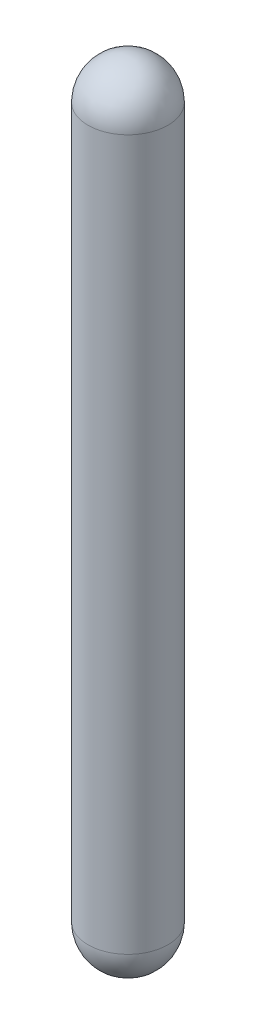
from build123d import *

# Parameters (mm, degrees)
ESQUISSE1_R       = 2.25
EXTRUSION1_DEPTH  = 40
D_ME1_FACE_RADIUS = 2.25
D_ME1_HEIGHT      = 2.25
D_ME2_FACE_RADIUS = 2.25
D_ME2_HEIGHT      = 2.25


with BuildPart() as part:
    # Esquisse1 → Extrusion1 (new body)
    with BuildSketch(Plane(origin=(0, 0, 0), x_dir=(1, 0, 0), z_dir=(0, 1, 0))):
        with Locations(Location((0, 0, 0), (0, 0, 270))):
            Circle(ESQUISSE1_R)
    extrude(amount=EXTRUSION1_DEPTH)

    # D_me1: an elliptical dome of height H over a round flat face of radius A is half a spheroid: the quarter ellipse of half axes A and H revolved about the face's axis
    with BuildSketch(Plane((0, 40, 0), x_dir=(0, 0, -1), z_dir=(1, 0, 0)), mode=Mode.PRIVATE) as d_me1_quarter:
        Ellipse(D_ME1_FACE_RADIUS, D_ME1_HEIGHT)
        Rectangle(D_ME1_FACE_RADIUS, D_ME1_HEIGHT, align=(Align.MIN, Align.MIN), mode=Mode.INTERSECT)
    revolve(d_me1_quarter.sketch, axis=Axis((0, 40, 0), (0, 1, 0)))

    # D_me2: a dome of height H over a round flat face of radius A is a cap of a sphere of radius (A * A + H * H) / (2 * H)
    d_me2_r = (D_ME2_FACE_RADIUS * D_ME2_FACE_RADIUS + D_ME2_HEIGHT * D_ME2_HEIGHT) / (2 * D_ME2_HEIGHT)
    d_me2_base = Plane((0, 0, 0), z_dir=(0, -1, 0))
    with Locations(d_me2_base.offset(D_ME2_HEIGHT - d_me2_r)):
        d_me2_ball = Sphere(d_me2_r, mode=Mode.PRIVATE)
    add(split(d_me2_ball, bisect_by=d_me2_base, keep=Keep.TOP, mode=Mode.PRIVATE))


solid = part.part
